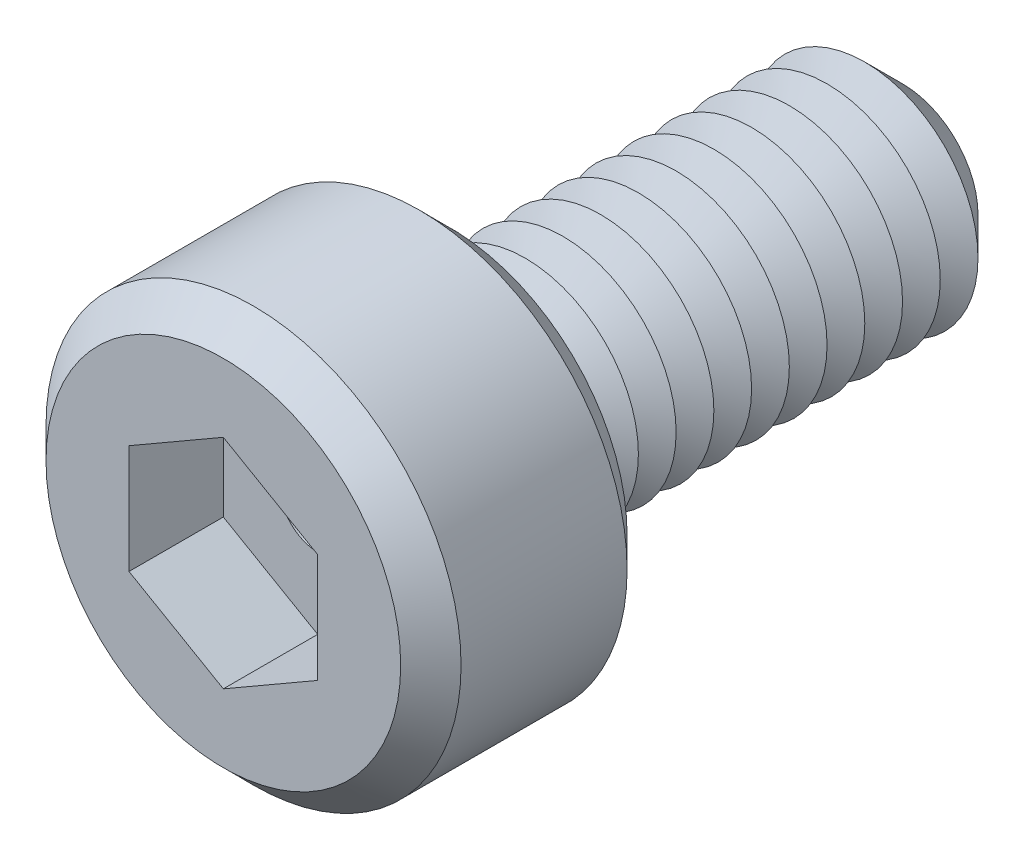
ISO-10303-21;
HEADER;
FILE_DESCRIPTION(('STEP AP214'),'2;1');
FILE_NAME('part.step','',(''),(''),'','','');
FILE_SCHEMA(('AUTOMOTIVE_DESIGN { 1 0 10303 214 1 1 1 1 }'));
ENDSEC;
DATA;
#1=APPLICATION_CONTEXT('core data for automotive mechanical design processes');
#2=APPLICATION_PROTOCOL_DEFINITION('international standard','automotive_design',2000,#1);
#3=PRODUCT_CONTEXT('',#1,'mechanical');
#4=PRODUCT('Part','Part','',(#3));
#5=PRODUCT_RELATED_PRODUCT_CATEGORY('part','',(#4));
#6=PRODUCT_DEFINITION_FORMATION('','',#4);
#7=PRODUCT_DEFINITION_CONTEXT('part definition',#1,'design');
#8=PRODUCT_DEFINITION('design','',#6,#7);
#9=PRODUCT_DEFINITION_SHAPE('','',#8);
#10=(LENGTH_UNIT() NAMED_UNIT(*) SI_UNIT(.MILLI.,.METRE.));
#11=(NAMED_UNIT(*) PLANE_ANGLE_UNIT() SI_UNIT($,.RADIAN.));
#12=(NAMED_UNIT(*) SI_UNIT($,.STERADIAN.) SOLID_ANGLE_UNIT());
#13=UNCERTAINTY_MEASURE_WITH_UNIT(LENGTH_MEASURE(1.E-05),#10,'distance_accuracy_value','');
#14=(GEOMETRIC_REPRESENTATION_CONTEXT(3) GLOBAL_UNCERTAINTY_ASSIGNED_CONTEXT((#13)) GLOBAL_UNIT_ASSIGNED_CONTEXT((#10,
#11,#12)) REPRESENTATION_CONTEXT('',''));
#15=CARTESIAN_POINT('',(0.,0.,0.));
#16=DIRECTION('',(0.,0.,1.));
#17=DIRECTION('',(1.,0.,0.));
#18=AXIS2_PLACEMENT_3D('',#15,#16,#17);
#19=CARTESIAN_POINT('',(0.,0.,3.));
#20=DIRECTION('',(0.,0.,-1.));
#21=DIRECTION('',(-1.,0.,0.));
#22=AXIS2_PLACEMENT_3D('',#19,#20,#21);
#23=CYLINDRICAL_SURFACE('',#22,2.75);
#24=CARTESIAN_POINT('',(0.,0.,0.4));
#25=DIRECTION('',(0.,0.,1.));
#26=DIRECTION('',(1.,0.,0.));
#27=AXIS2_PLACEMENT_3D('',#24,#25,#26);
#28=CIRCLE('',#27,2.75);
#29=CARTESIAN_POINT('',(2.75,0.,0.4));
#30=VERTEX_POINT('',#29);
#31=EDGE_CURVE('E264',#30,#30,#28,.T.);
#32=ORIENTED_EDGE('',*,*,#31,.T.);
#33=EDGE_LOOP('',(#32));
#34=FACE_BOUND('',#33,.T.);
#35=CARTESIAN_POINT('',(0.,0.,2.6));
#36=DIRECTION('',(0.,0.,1.));
#37=DIRECTION('',(1.,0.,0.));
#38=AXIS2_PLACEMENT_3D('',#35,#36,#37);
#39=CIRCLE('',#38,2.75);
#40=CARTESIAN_POINT('',(2.75,0.,2.6));
#41=VERTEX_POINT('',#40);
#42=EDGE_CURVE('E260',#41,#41,#39,.F.);
#43=ORIENTED_EDGE('',*,*,#42,.T.);
#44=EDGE_LOOP('',(#43));
#45=FACE_BOUND('',#44,.T.);
#46=ADVANCED_FACE('F39',(#34,#45),#23,.T.);
#47=CARTESIAN_POINT('',(0.,0.,3.));
#48=DIRECTION('',(0.,0.,1.));
#49=DIRECTION('',(1.,0.,0.));
#50=AXIS2_PLACEMENT_3D('',#47,#48,#49);
#51=PLANE('',#50);
#52=CARTESIAN_POINT('',(0.,0.,3.));
#53=DIRECTION('',(0.,0.,1.));
#54=DIRECTION('',(1.,0.,0.));
#55=AXIS2_PLACEMENT_3D('',#52,#53,#54);
#56=CIRCLE('',#55,2.35);
#57=CARTESIAN_POINT('',(2.35,0.,3.));
#58=VERTEX_POINT('',#57);
#59=EDGE_CURVE('E11',#58,#58,#56,.T.);
#60=ORIENTED_EDGE('',*,*,#59,.T.);
#61=EDGE_LOOP('',(#60));
#62=FACE_BOUND('',#61,.T.);
#63=DIRECTION('',(-0.866025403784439,0.5,0.));
#64=VECTOR('',#63,1.);
#65=CARTESIAN_POINT('',(1.25,0.721687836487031,3.));
#66=LINE('',#65,#64);
#67=CARTESIAN_POINT('',(1.25,0.721687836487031,3.));
#68=VERTEX_POINT('',#67);
#69=CARTESIAN_POINT('',(0.,1.44337567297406,3.));
#70=VERTEX_POINT('',#69);
#71=EDGE_CURVE('E55',#68,#70,#66,.T.);
#72=ORIENTED_EDGE('',*,*,#71,.F.);
#73=DIRECTION('',(0.,1.,0.));
#74=VECTOR('',#73,1.);
#75=CARTESIAN_POINT('',(1.25,-0.721687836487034,3.));
#76=LINE('',#75,#74);
#77=CARTESIAN_POINT('',(1.25,-0.721687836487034,3.));
#78=VERTEX_POINT('',#77);
#79=EDGE_CURVE('E150',#78,#68,#76,.T.);
#80=ORIENTED_EDGE('',*,*,#79,.F.);
#81=DIRECTION('',(0.866025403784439,0.5,0.));
#82=VECTOR('',#81,1.);
#83=CARTESIAN_POINT('',(0.,-1.44337567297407,3.));
#84=LINE('',#83,#82);
#85=CARTESIAN_POINT('',(0.,-1.44337567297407,3.));
#86=VERTEX_POINT('',#85);
#87=EDGE_CURVE('E147',#86,#78,#84,.T.);
#88=ORIENTED_EDGE('',*,*,#87,.F.);
#89=DIRECTION('',(0.866025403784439,-0.5,0.));
#90=VECTOR('',#89,1.);
#91=CARTESIAN_POINT('',(-1.25,-0.721687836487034,3.));
#92=LINE('',#91,#90);
#93=CARTESIAN_POINT('',(-1.25,-0.721687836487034,3.));
#94=VERTEX_POINT('',#93);
#95=EDGE_CURVE('E103',#94,#86,#92,.T.);
#96=ORIENTED_EDGE('',*,*,#95,.F.);
#97=DIRECTION('',(0.,-1.,0.));
#98=VECTOR('',#97,1.);
#99=CARTESIAN_POINT('',(-1.25,0.721687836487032,3.));
#100=LINE('',#99,#98);
#101=CARTESIAN_POINT('',(-1.25,0.721687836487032,3.));
#102=VERTEX_POINT('',#101);
#103=EDGE_CURVE('E141',#102,#94,#100,.T.);
#104=ORIENTED_EDGE('',*,*,#103,.F.);
#105=DIRECTION('',(-0.866025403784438,-0.5,0.));
#106=VECTOR('',#105,1.);
#107=CARTESIAN_POINT('',(0.,1.44337567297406,3.));
#108=LINE('',#107,#106);
#109=EDGE_CURVE('E136',#70,#102,#108,.T.);
#110=ORIENTED_EDGE('',*,*,#109,.F.);
#111=EDGE_LOOP('',(#72,#80,#88,#96,#104,#110));
#112=FACE_BOUND('',#111,.T.);
#113=ADVANCED_FACE('F282',(#62,#112),#51,.T.);
#114=CARTESIAN_POINT('',(0.,0.,0.));
#115=DIRECTION('',(0.,0.,1.));
#116=DIRECTION('',(1.,0.,0.));
#117=AXIS2_PLACEMENT_3D('',#114,#115,#116);
#118=PLANE('',#117);
#119=CARTESIAN_POINT('',(0.,0.,0.));
#120=DIRECTION('',(0.,0.,1.));
#121=DIRECTION('',(1.,0.,0.));
#122=AXIS2_PLACEMENT_3D('',#119,#120,#121);
#123=CIRCLE('',#122,2.35);
#124=CARTESIAN_POINT('',(2.35,0.,0.));
#125=VERTEX_POINT('',#124);
#126=EDGE_CURVE('E48',#125,#125,#123,.F.);
#127=ORIENTED_EDGE('',*,*,#126,.T.);
#128=EDGE_LOOP('',(#127));
#129=FACE_BOUND('',#128,.T.);
#130=CARTESIAN_POINT('',(0.,0.,0.));
#131=DIRECTION('',(0.,0.,1.));
#132=DIRECTION('',(1.,0.,0.));
#133=AXIS2_PLACEMENT_3D('',#130,#131,#132);
#134=CIRCLE('',#133,1.5);
#135=CARTESIAN_POINT('',(1.5,0.,0.));
#136=VERTEX_POINT('',#135);
#137=EDGE_CURVE('E252',#136,#136,#134,.T.);
#138=ORIENTED_EDGE('',*,*,#137,.T.);
#139=EDGE_LOOP('',(#138));
#140=FACE_BOUND('',#139,.T.);
#141=ADVANCED_FACE('F271',(#129,#140),#118,.F.);
#142=CARTESIAN_POINT('',(0.,0.,0.));
#143=DIRECTION('',(0.,0.,1.));
#144=DIRECTION('',(1.,0.,0.));
#145=AXIS2_PLACEMENT_3D('',#142,#143,#144);
#146=CONICAL_SURFACE('',#145,1.5,1.0471975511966);
#147=CARTESIAN_POINT('',(0.,0.,-0.250000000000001));
#148=DIRECTION('',(0.,0.,1.));
#149=DIRECTION('',(1.,0.,0.));
#150=AXIS2_PLACEMENT_3D('',#147,#148,#149);
#151=CIRCLE('',#150,1.06698729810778);
#152=CARTESIAN_POINT('',(1.06698729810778,0.,-0.250000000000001));
#153=VERTEX_POINT('',#152);
#154=EDGE_CURVE('E248',#153,#153,#151,.T.);
#155=ORIENTED_EDGE('',*,*,#154,.T.);
#156=EDGE_LOOP('',(#155));
#157=FACE_BOUND('',#156,.T.);
#158=ORIENTED_EDGE('',*,*,#137,.F.);
#159=EDGE_LOOP('',(#158));
#160=FACE_BOUND('',#159,.T.);
#161=ADVANCED_FACE('F420',(#157,#160),#146,.T.);
#162=CARTESIAN_POINT('',(0.,0.,-0.250000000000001));
#163=DIRECTION('',(0.,0.,-1.));
#164=DIRECTION('',(-1.,0.,0.));
#165=AXIS2_PLACEMENT_3D('',#162,#163,#164);
#166=CONICAL_SURFACE('',#165,1.06698729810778,1.0471975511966);
#167=CARTESIAN_POINT('',(0.,0.,-0.5));
#168=DIRECTION('',(0.,0.,1.));
#169=DIRECTION('',(1.,0.,0.));
#170=AXIS2_PLACEMENT_3D('',#167,#168,#169);
#171=CIRCLE('',#170,1.5);
#172=CARTESIAN_POINT('',(1.5,0.,-0.5));
#173=VERTEX_POINT('',#172);
#174=EDGE_CURVE('E244',#173,#173,#171,.T.);
#175=ORIENTED_EDGE('',*,*,#174,.T.);
#176=EDGE_LOOP('',(#175));
#177=FACE_BOUND('',#176,.T.);
#178=ORIENTED_EDGE('',*,*,#154,.F.);
#179=EDGE_LOOP('',(#178));
#180=FACE_BOUND('',#179,.T.);
#181=ADVANCED_FACE('F416',(#177,#180),#166,.T.);
#182=CARTESIAN_POINT('',(0.,0.,-0.5));
#183=DIRECTION('',(0.,0.,1.));
#184=DIRECTION('',(1.,0.,0.));
#185=AXIS2_PLACEMENT_3D('',#182,#183,#184);
#186=CONICAL_SURFACE('',#185,1.5,1.0471975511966);
#187=CARTESIAN_POINT('',(0.,0.,-0.750000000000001));
#188=DIRECTION('',(0.,0.,1.));
#189=DIRECTION('',(1.,0.,0.));
#190=AXIS2_PLACEMENT_3D('',#187,#188,#189);
#191=CIRCLE('',#190,1.06698729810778);
#192=CARTESIAN_POINT('',(1.06698729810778,0.,-0.750000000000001));
#193=VERTEX_POINT('',#192);
#194=EDGE_CURVE('E240',#193,#193,#191,.T.);
#195=ORIENTED_EDGE('',*,*,#194,.T.);
#196=EDGE_LOOP('',(#195));
#197=FACE_BOUND('',#196,.T.);
#198=ORIENTED_EDGE('',*,*,#174,.F.);
#199=EDGE_LOOP('',(#198));
#200=FACE_BOUND('',#199,.T.);
#201=ADVANCED_FACE('F412',(#197,#200),#186,.T.);
#202=CARTESIAN_POINT('',(0.,0.,-0.750000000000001));
#203=DIRECTION('',(0.,0.,-1.));
#204=DIRECTION('',(-1.,0.,0.));
#205=AXIS2_PLACEMENT_3D('',#202,#203,#204);
#206=CONICAL_SURFACE('',#205,1.06698729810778,1.0471975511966);
#207=CARTESIAN_POINT('',(0.,0.,-1.));
#208=DIRECTION('',(0.,0.,1.));
#209=DIRECTION('',(1.,0.,0.));
#210=AXIS2_PLACEMENT_3D('',#207,#208,#209);
#211=CIRCLE('',#210,1.5);
#212=CARTESIAN_POINT('',(1.5,0.,-1.));
#213=VERTEX_POINT('',#212);
#214=EDGE_CURVE('E236',#213,#213,#211,.T.);
#215=ORIENTED_EDGE('',*,*,#214,.T.);
#216=EDGE_LOOP('',(#215));
#217=FACE_BOUND('',#216,.T.);
#218=ORIENTED_EDGE('',*,*,#194,.F.);
#219=EDGE_LOOP('',(#218));
#220=FACE_BOUND('',#219,.T.);
#221=ADVANCED_FACE('F408',(#217,#220),#206,.T.);
#222=CARTESIAN_POINT('',(0.,0.,-1.));
#223=DIRECTION('',(0.,0.,1.));
#224=DIRECTION('',(1.,0.,0.));
#225=AXIS2_PLACEMENT_3D('',#222,#223,#224);
#226=CONICAL_SURFACE('',#225,1.5,1.0471975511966);
#227=CARTESIAN_POINT('',(0.,0.,-1.25));
#228=DIRECTION('',(0.,0.,1.));
#229=DIRECTION('',(1.,0.,0.));
#230=AXIS2_PLACEMENT_3D('',#227,#228,#229);
#231=CIRCLE('',#230,1.06698729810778);
#232=CARTESIAN_POINT('',(1.06698729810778,0.,-1.25));
#233=VERTEX_POINT('',#232);
#234=EDGE_CURVE('E232',#233,#233,#231,.T.);
#235=ORIENTED_EDGE('',*,*,#234,.T.);
#236=EDGE_LOOP('',(#235));
#237=FACE_BOUND('',#236,.T.);
#238=ORIENTED_EDGE('',*,*,#214,.F.);
#239=EDGE_LOOP('',(#238));
#240=FACE_BOUND('',#239,.T.);
#241=ADVANCED_FACE('F404',(#237,#240),#226,.T.);
#242=CARTESIAN_POINT('',(0.,0.,-1.25));
#243=DIRECTION('',(0.,0.,-1.));
#244=DIRECTION('',(-1.,0.,0.));
#245=AXIS2_PLACEMENT_3D('',#242,#243,#244);
#246=CONICAL_SURFACE('',#245,1.06698729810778,1.0471975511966);
#247=CARTESIAN_POINT('',(0.,0.,-1.5));
#248=DIRECTION('',(0.,0.,1.));
#249=DIRECTION('',(1.,0.,0.));
#250=AXIS2_PLACEMENT_3D('',#247,#248,#249);
#251=CIRCLE('',#250,1.5);
#252=CARTESIAN_POINT('',(1.5,0.,-1.5));
#253=VERTEX_POINT('',#252);
#254=EDGE_CURVE('E228',#253,#253,#251,.T.);
#255=ORIENTED_EDGE('',*,*,#254,.T.);
#256=EDGE_LOOP('',(#255));
#257=FACE_BOUND('',#256,.T.);
#258=ORIENTED_EDGE('',*,*,#234,.F.);
#259=EDGE_LOOP('',(#258));
#260=FACE_BOUND('',#259,.T.);
#261=ADVANCED_FACE('F400',(#257,#260),#246,.T.);
#262=CARTESIAN_POINT('',(0.,0.,-1.5));
#263=DIRECTION('',(0.,0.,1.));
#264=DIRECTION('',(1.,0.,0.));
#265=AXIS2_PLACEMENT_3D('',#262,#263,#264);
#266=CONICAL_SURFACE('',#265,1.5,1.0471975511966);
#267=CARTESIAN_POINT('',(0.,0.,-1.75));
#268=DIRECTION('',(0.,0.,1.));
#269=DIRECTION('',(1.,0.,0.));
#270=AXIS2_PLACEMENT_3D('',#267,#268,#269);
#271=CIRCLE('',#270,1.06698729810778);
#272=CARTESIAN_POINT('',(1.06698729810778,0.,-1.75));
#273=VERTEX_POINT('',#272);
#274=EDGE_CURVE('E224',#273,#273,#271,.T.);
#275=ORIENTED_EDGE('',*,*,#274,.T.);
#276=EDGE_LOOP('',(#275));
#277=FACE_BOUND('',#276,.T.);
#278=ORIENTED_EDGE('',*,*,#254,.F.);
#279=EDGE_LOOP('',(#278));
#280=FACE_BOUND('',#279,.T.);
#281=ADVANCED_FACE('F396',(#277,#280),#266,.T.);
#282=CARTESIAN_POINT('',(0.,0.,-1.75));
#283=DIRECTION('',(0.,0.,-1.));
#284=DIRECTION('',(-1.,0.,0.));
#285=AXIS2_PLACEMENT_3D('',#282,#283,#284);
#286=CONICAL_SURFACE('',#285,1.06698729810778,1.0471975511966);
#287=CARTESIAN_POINT('',(0.,0.,-2.));
#288=DIRECTION('',(0.,0.,1.));
#289=DIRECTION('',(1.,0.,0.));
#290=AXIS2_PLACEMENT_3D('',#287,#288,#289);
#291=CIRCLE('',#290,1.5);
#292=CARTESIAN_POINT('',(1.5,0.,-2.));
#293=VERTEX_POINT('',#292);
#294=EDGE_CURVE('E220',#293,#293,#291,.T.);
#295=ORIENTED_EDGE('',*,*,#294,.T.);
#296=EDGE_LOOP('',(#295));
#297=FACE_BOUND('',#296,.T.);
#298=ORIENTED_EDGE('',*,*,#274,.F.);
#299=EDGE_LOOP('',(#298));
#300=FACE_BOUND('',#299,.T.);
#301=ADVANCED_FACE('F392',(#297,#300),#286,.T.);
#302=CARTESIAN_POINT('',(0.,0.,-2.));
#303=DIRECTION('',(0.,0.,1.));
#304=DIRECTION('',(1.,0.,0.));
#305=AXIS2_PLACEMENT_3D('',#302,#303,#304);
#306=CONICAL_SURFACE('',#305,1.5,1.0471975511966);
#307=CARTESIAN_POINT('',(0.,0.,-2.25));
#308=DIRECTION('',(0.,0.,1.));
#309=DIRECTION('',(1.,0.,0.));
#310=AXIS2_PLACEMENT_3D('',#307,#308,#309);
#311=CIRCLE('',#310,1.06698729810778);
#312=CARTESIAN_POINT('',(1.06698729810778,0.,-2.25));
#313=VERTEX_POINT('',#312);
#314=EDGE_CURVE('E216',#313,#313,#311,.T.);
#315=ORIENTED_EDGE('',*,*,#314,.T.);
#316=EDGE_LOOP('',(#315));
#317=FACE_BOUND('',#316,.T.);
#318=ORIENTED_EDGE('',*,*,#294,.F.);
#319=EDGE_LOOP('',(#318));
#320=FACE_BOUND('',#319,.T.);
#321=ADVANCED_FACE('F388',(#317,#320),#306,.T.);
#322=CARTESIAN_POINT('',(0.,0.,-2.25));
#323=DIRECTION('',(0.,0.,-1.));
#324=DIRECTION('',(-1.,0.,0.));
#325=AXIS2_PLACEMENT_3D('',#322,#323,#324);
#326=CONICAL_SURFACE('',#325,1.06698729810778,1.0471975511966);
#327=CARTESIAN_POINT('',(0.,0.,-2.5));
#328=DIRECTION('',(0.,0.,1.));
#329=DIRECTION('',(1.,0.,0.));
#330=AXIS2_PLACEMENT_3D('',#327,#328,#329);
#331=CIRCLE('',#330,1.5);
#332=CARTESIAN_POINT('',(1.5,0.,-2.5));
#333=VERTEX_POINT('',#332);
#334=EDGE_CURVE('E212',#333,#333,#331,.T.);
#335=ORIENTED_EDGE('',*,*,#334,.T.);
#336=EDGE_LOOP('',(#335));
#337=FACE_BOUND('',#336,.T.);
#338=ORIENTED_EDGE('',*,*,#314,.F.);
#339=EDGE_LOOP('',(#338));
#340=FACE_BOUND('',#339,.T.);
#341=ADVANCED_FACE('F384',(#337,#340),#326,.T.);
#342=CARTESIAN_POINT('',(0.,0.,-2.5));
#343=DIRECTION('',(0.,0.,1.));
#344=DIRECTION('',(1.,0.,0.));
#345=AXIS2_PLACEMENT_3D('',#342,#343,#344);
#346=CONICAL_SURFACE('',#345,1.5,1.0471975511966);
#347=CARTESIAN_POINT('',(0.,0.,-2.75));
#348=DIRECTION('',(0.,0.,1.));
#349=DIRECTION('',(1.,0.,0.));
#350=AXIS2_PLACEMENT_3D('',#347,#348,#349);
#351=CIRCLE('',#350,1.06698729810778);
#352=CARTESIAN_POINT('',(1.06698729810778,0.,-2.75));
#353=VERTEX_POINT('',#352);
#354=EDGE_CURVE('E208',#353,#353,#351,.T.);
#355=ORIENTED_EDGE('',*,*,#354,.T.);
#356=EDGE_LOOP('',(#355));
#357=FACE_BOUND('',#356,.T.);
#358=ORIENTED_EDGE('',*,*,#334,.F.);
#359=EDGE_LOOP('',(#358));
#360=FACE_BOUND('',#359,.T.);
#361=ADVANCED_FACE('F380',(#357,#360),#346,.T.);
#362=CARTESIAN_POINT('',(0.,0.,-2.75));
#363=DIRECTION('',(0.,0.,-1.));
#364=DIRECTION('',(-1.,0.,0.));
#365=AXIS2_PLACEMENT_3D('',#362,#363,#364);
#366=CONICAL_SURFACE('',#365,1.06698729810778,1.0471975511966);
#367=CARTESIAN_POINT('',(0.,0.,-3.));
#368=DIRECTION('',(0.,0.,1.));
#369=DIRECTION('',(1.,0.,0.));
#370=AXIS2_PLACEMENT_3D('',#367,#368,#369);
#371=CIRCLE('',#370,1.5);
#372=CARTESIAN_POINT('',(1.5,0.,-3.));
#373=VERTEX_POINT('',#372);
#374=EDGE_CURVE('E204',#373,#373,#371,.T.);
#375=ORIENTED_EDGE('',*,*,#374,.T.);
#376=EDGE_LOOP('',(#375));
#377=FACE_BOUND('',#376,.T.);
#378=ORIENTED_EDGE('',*,*,#354,.F.);
#379=EDGE_LOOP('',(#378));
#380=FACE_BOUND('',#379,.T.);
#381=ADVANCED_FACE('F376',(#377,#380),#366,.T.);
#382=CARTESIAN_POINT('',(0.,0.,-3.));
#383=DIRECTION('',(0.,0.,1.));
#384=DIRECTION('',(1.,0.,0.));
#385=AXIS2_PLACEMENT_3D('',#382,#383,#384);
#386=CONICAL_SURFACE('',#385,1.5,1.0471975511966);
#387=CARTESIAN_POINT('',(0.,0.,-3.25));
#388=DIRECTION('',(0.,0.,1.));
#389=DIRECTION('',(1.,0.,0.));
#390=AXIS2_PLACEMENT_3D('',#387,#388,#389);
#391=CIRCLE('',#390,1.06698729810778);
#392=CARTESIAN_POINT('',(1.06698729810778,0.,-3.25));
#393=VERTEX_POINT('',#392);
#394=EDGE_CURVE('E200',#393,#393,#391,.T.);
#395=ORIENTED_EDGE('',*,*,#394,.T.);
#396=EDGE_LOOP('',(#395));
#397=FACE_BOUND('',#396,.T.);
#398=ORIENTED_EDGE('',*,*,#374,.F.);
#399=EDGE_LOOP('',(#398));
#400=FACE_BOUND('',#399,.T.);
#401=ADVANCED_FACE('F372',(#397,#400),#386,.T.);
#402=CARTESIAN_POINT('',(0.,0.,-3.25));
#403=DIRECTION('',(0.,0.,-1.));
#404=DIRECTION('',(-1.,0.,0.));
#405=AXIS2_PLACEMENT_3D('',#402,#403,#404);
#406=CONICAL_SURFACE('',#405,1.06698729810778,1.0471975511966);
#407=CARTESIAN_POINT('',(0.,0.,-3.5));
#408=DIRECTION('',(0.,0.,1.));
#409=DIRECTION('',(1.,0.,0.));
#410=AXIS2_PLACEMENT_3D('',#407,#408,#409);
#411=CIRCLE('',#410,1.5);
#412=CARTESIAN_POINT('',(1.5,0.,-3.5));
#413=VERTEX_POINT('',#412);
#414=EDGE_CURVE('E196',#413,#413,#411,.T.);
#415=ORIENTED_EDGE('',*,*,#414,.T.);
#416=EDGE_LOOP('',(#415));
#417=FACE_BOUND('',#416,.T.);
#418=ORIENTED_EDGE('',*,*,#394,.F.);
#419=EDGE_LOOP('',(#418));
#420=FACE_BOUND('',#419,.T.);
#421=ADVANCED_FACE('F368',(#417,#420),#406,.T.);
#422=CARTESIAN_POINT('',(0.,0.,-3.5));
#423=DIRECTION('',(0.,0.,1.));
#424=DIRECTION('',(1.,0.,0.));
#425=AXIS2_PLACEMENT_3D('',#422,#423,#424);
#426=CONICAL_SURFACE('',#425,1.5,1.0471975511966);
#427=CARTESIAN_POINT('',(0.,0.,-3.75));
#428=DIRECTION('',(0.,0.,1.));
#429=DIRECTION('',(1.,0.,0.));
#430=AXIS2_PLACEMENT_3D('',#427,#428,#429);
#431=CIRCLE('',#430,1.06698729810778);
#432=CARTESIAN_POINT('',(1.06698729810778,0.,-3.75));
#433=VERTEX_POINT('',#432);
#434=EDGE_CURVE('E192',#433,#433,#431,.T.);
#435=ORIENTED_EDGE('',*,*,#434,.T.);
#436=EDGE_LOOP('',(#435));
#437=FACE_BOUND('',#436,.T.);
#438=ORIENTED_EDGE('',*,*,#414,.F.);
#439=EDGE_LOOP('',(#438));
#440=FACE_BOUND('',#439,.T.);
#441=ADVANCED_FACE('F364',(#437,#440),#426,.T.);
#442=CARTESIAN_POINT('',(0.,0.,-3.75));
#443=DIRECTION('',(0.,0.,-1.));
#444=DIRECTION('',(-1.,0.,0.));
#445=AXIS2_PLACEMENT_3D('',#442,#443,#444);
#446=CONICAL_SURFACE('',#445,1.06698729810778,1.0471975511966);
#447=CARTESIAN_POINT('',(0.,0.,-4.));
#448=DIRECTION('',(0.,0.,1.));
#449=DIRECTION('',(1.,0.,0.));
#450=AXIS2_PLACEMENT_3D('',#447,#448,#449);
#451=CIRCLE('',#450,1.5);
#452=CARTESIAN_POINT('',(1.5,0.,-4.));
#453=VERTEX_POINT('',#452);
#454=EDGE_CURVE('E188',#453,#453,#451,.T.);
#455=ORIENTED_EDGE('',*,*,#454,.T.);
#456=EDGE_LOOP('',(#455));
#457=FACE_BOUND('',#456,.T.);
#458=ORIENTED_EDGE('',*,*,#434,.F.);
#459=EDGE_LOOP('',(#458));
#460=FACE_BOUND('',#459,.T.);
#461=ADVANCED_FACE('F360',(#457,#460),#446,.T.);
#462=CARTESIAN_POINT('',(0.,0.,-4.));
#463=DIRECTION('',(0.,0.,1.));
#464=DIRECTION('',(1.,0.,0.));
#465=AXIS2_PLACEMENT_3D('',#462,#463,#464);
#466=CONICAL_SURFACE('',#465,1.5,1.0471975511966);
#467=CARTESIAN_POINT('',(0.,0.,-4.25));
#468=DIRECTION('',(0.,0.,1.));
#469=DIRECTION('',(1.,0.,0.));
#470=AXIS2_PLACEMENT_3D('',#467,#468,#469);
#471=CIRCLE('',#470,1.06698729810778);
#472=CARTESIAN_POINT('',(1.06698729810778,0.,-4.25));
#473=VERTEX_POINT('',#472);
#474=EDGE_CURVE('E184',#473,#473,#471,.T.);
#475=ORIENTED_EDGE('',*,*,#474,.T.);
#476=EDGE_LOOP('',(#475));
#477=FACE_BOUND('',#476,.T.);
#478=ORIENTED_EDGE('',*,*,#454,.F.);
#479=EDGE_LOOP('',(#478));
#480=FACE_BOUND('',#479,.T.);
#481=ADVANCED_FACE('F356',(#477,#480),#466,.T.);
#482=CARTESIAN_POINT('',(0.,0.,-4.25));
#483=DIRECTION('',(0.,0.,-1.));
#484=DIRECTION('',(-1.,0.,0.));
#485=AXIS2_PLACEMENT_3D('',#482,#483,#484);
#486=CONICAL_SURFACE('',#485,1.06698729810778,1.0471975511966);
#487=CARTESIAN_POINT('',(0.,0.,-4.5));
#488=DIRECTION('',(0.,0.,1.));
#489=DIRECTION('',(1.,0.,0.));
#490=AXIS2_PLACEMENT_3D('',#487,#488,#489);
#491=CIRCLE('',#490,1.5);
#492=CARTESIAN_POINT('',(1.5,0.,-4.5));
#493=VERTEX_POINT('',#492);
#494=EDGE_CURVE('E180',#493,#493,#491,.T.);
#495=ORIENTED_EDGE('',*,*,#494,.T.);
#496=EDGE_LOOP('',(#495));
#497=FACE_BOUND('',#496,.T.);
#498=ORIENTED_EDGE('',*,*,#474,.F.);
#499=EDGE_LOOP('',(#498));
#500=FACE_BOUND('',#499,.T.);
#501=ADVANCED_FACE('F352',(#497,#500),#486,.T.);
#502=CARTESIAN_POINT('',(0.,0.,-4.5));
#503=DIRECTION('',(0.,0.,1.));
#504=DIRECTION('',(1.,0.,0.));
#505=AXIS2_PLACEMENT_3D('',#502,#503,#504);
#506=CONICAL_SURFACE('',#505,1.5,1.0471975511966);
#507=CARTESIAN_POINT('',(0.,0.,-4.75));
#508=DIRECTION('',(0.,0.,1.));
#509=DIRECTION('',(1.,0.,0.));
#510=AXIS2_PLACEMENT_3D('',#507,#508,#509);
#511=CIRCLE('',#510,1.06698729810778);
#512=CARTESIAN_POINT('',(1.06698729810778,0.,-4.75));
#513=VERTEX_POINT('',#512);
#514=EDGE_CURVE('E176',#513,#513,#511,.T.);
#515=ORIENTED_EDGE('',*,*,#514,.T.);
#516=EDGE_LOOP('',(#515));
#517=FACE_BOUND('',#516,.T.);
#518=ORIENTED_EDGE('',*,*,#494,.F.);
#519=EDGE_LOOP('',(#518));
#520=FACE_BOUND('',#519,.T.);
#521=ADVANCED_FACE('F348',(#517,#520),#506,.T.);
#522=CARTESIAN_POINT('',(0.,0.,-4.75));
#523=DIRECTION('',(0.,0.,-1.));
#524=DIRECTION('',(-1.,0.,0.));
#525=AXIS2_PLACEMENT_3D('',#522,#523,#524);
#526=CONICAL_SURFACE('',#525,1.06698729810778,1.0471975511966);
#527=CARTESIAN_POINT('',(0.,0.,-5.));
#528=DIRECTION('',(0.,0.,1.));
#529=DIRECTION('',(1.,0.,0.));
#530=AXIS2_PLACEMENT_3D('',#527,#528,#529);
#531=CIRCLE('',#530,1.5);
#532=CARTESIAN_POINT('',(1.5,0.,-5.));
#533=VERTEX_POINT('',#532);
#534=EDGE_CURVE('E172',#533,#533,#531,.T.);
#535=ORIENTED_EDGE('',*,*,#534,.T.);
#536=EDGE_LOOP('',(#535));
#537=FACE_BOUND('',#536,.T.);
#538=ORIENTED_EDGE('',*,*,#514,.F.);
#539=EDGE_LOOP('',(#538));
#540=FACE_BOUND('',#539,.T.);
#541=ADVANCED_FACE('F344',(#537,#540),#526,.T.);
#542=CARTESIAN_POINT('',(0.,0.,-5.));
#543=DIRECTION('',(0.,0.,1.));
#544=DIRECTION('',(1.,0.,0.));
#545=AXIS2_PLACEMENT_3D('',#542,#543,#544);
#546=CONICAL_SURFACE('',#545,1.5,1.0471975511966);
#547=CARTESIAN_POINT('',(0.,0.,-5.25));
#548=DIRECTION('',(0.,0.,1.));
#549=DIRECTION('',(1.,0.,0.));
#550=AXIS2_PLACEMENT_3D('',#547,#548,#549);
#551=CIRCLE('',#550,1.06698729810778);
#552=CARTESIAN_POINT('',(1.06698729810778,0.,-5.25));
#553=VERTEX_POINT('',#552);
#554=EDGE_CURVE('E169',#553,#553,#551,.T.);
#555=ORIENTED_EDGE('',*,*,#554,.T.);
#556=EDGE_LOOP('',(#555));
#557=FACE_BOUND('',#556,.T.);
#558=ORIENTED_EDGE('',*,*,#534,.F.);
#559=EDGE_LOOP('',(#558));
#560=FACE_BOUND('',#559,.T.);
#561=ADVANCED_FACE('F340',(#557,#560),#546,.T.);
#562=CARTESIAN_POINT('',(0.,0.,-5.25));
#563=DIRECTION('',(0.,0.,-1.));
#564=DIRECTION('',(-1.,0.,0.));
#565=AXIS2_PLACEMENT_3D('',#562,#563,#564);
#566=CONICAL_SURFACE('',#565,1.06698729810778,1.0471975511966);
#567=CARTESIAN_POINT('',(0.,0.,-5.5));
#568=DIRECTION('',(0.,0.,1.));
#569=DIRECTION('',(1.,0.,0.));
#570=AXIS2_PLACEMENT_3D('',#567,#568,#569);
#571=CIRCLE('',#570,1.5);
#572=CARTESIAN_POINT('',(1.5,0.,-5.5));
#573=VERTEX_POINT('',#572);
#574=EDGE_CURVE('E156',#573,#573,#571,.T.);
#575=ORIENTED_EDGE('',*,*,#574,.T.);
#576=EDGE_LOOP('',(#575));
#577=FACE_BOUND('',#576,.T.);
#578=ORIENTED_EDGE('',*,*,#554,.F.);
#579=EDGE_LOOP('',(#578));
#580=FACE_BOUND('',#579,.T.);
#581=ADVANCED_FACE('F336',(#577,#580),#566,.T.);
#582=CARTESIAN_POINT('',(0.,0.,-6.));
#583=DIRECTION('',(0.,0.,-1.));
#584=DIRECTION('',(-1.,0.,0.));
#585=AXIS2_PLACEMENT_3D('',#582,#583,#584);
#586=PLANE('',#585);
#587=CARTESIAN_POINT('',(0.,0.,-6.));
#588=DIRECTION('',(0.,0.,-1.));
#589=DIRECTION('',(-1.,0.,0.));
#590=AXIS2_PLACEMENT_3D('',#587,#588,#589);
#591=CIRCLE('',#590,0.5);
#592=CARTESIAN_POINT('',(-0.5,0.,-6.));
#593=VERTEX_POINT('',#592);
#594=EDGE_CURVE('E137',#593,#593,#591,.F.);
#595=ORIENTED_EDGE('',*,*,#594,.T.);
#596=EDGE_LOOP('',(#595));
#597=FACE_BOUND('',#596,.T.);
#598=CARTESIAN_POINT('',(0.,0.,-6.));
#599=DIRECTION('',(0.,0.,-1.));
#600=DIRECTION('',(-1.,0.,0.));
#601=AXIS2_PLACEMENT_3D('',#598,#599,#600);
#602=CIRCLE('',#601,1.);
#603=CARTESIAN_POINT('',(-1.,0.,-6.));
#604=VERTEX_POINT('',#603);
#605=EDGE_CURVE('E256',#604,#604,#602,.T.);
#606=ORIENTED_EDGE('',*,*,#605,.T.);
#607=EDGE_LOOP('',(#606));
#608=FACE_BOUND('',#607,.T.);
#609=ADVANCED_FACE('F339',(#597,#608),#586,.T.);
#610=CARTESIAN_POINT('',(0.,0.,-6.));
#611=DIRECTION('',(0.,0.,1.));
#612=DIRECTION('',(1.,0.,0.));
#613=AXIS2_PLACEMENT_3D('',#610,#611,#612);
#614=CONICAL_SURFACE('',#613,1.,0.785398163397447);
#615=ORIENTED_EDGE('',*,*,#574,.F.);
#616=EDGE_LOOP('',(#615));
#617=FACE_BOUND('',#616,.T.);
#618=ORIENTED_EDGE('',*,*,#605,.F.);
#619=EDGE_LOOP('',(#618));
#620=FACE_BOUND('',#619,.T.);
#621=ADVANCED_FACE('F335',(#617,#620),#614,.T.);
#622=CARTESIAN_POINT('',(1.25,0.721687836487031,1.75));
#623=DIRECTION('',(0.5,0.866025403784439,0.));
#624=DIRECTION('',(-0.866025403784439,0.5,0.));
#625=AXIS2_PLACEMENT_3D('',#622,#623,#624);
#626=PLANE('',#625);
#627=ORIENTED_EDGE('',*,*,#71,.T.);
#628=DIRECTION('',(0.,0.,1.));
#629=VECTOR('',#628,1.);
#630=CARTESIAN_POINT('',(0.,1.44337567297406,1.75));
#631=LINE('',#630,#629);
#632=CARTESIAN_POINT('',(0.,1.44337567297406,1.75));
#633=VERTEX_POINT('',#632);
#634=EDGE_CURVE('E85',#633,#70,#631,.T.);
#635=ORIENTED_EDGE('',*,*,#634,.F.);
#636=DIRECTION('',(-0.866025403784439,0.5,0.));
#637=VECTOR('',#636,1.);
#638=CARTESIAN_POINT('',(1.25,0.721687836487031,1.75));
#639=LINE('',#638,#637);
#640=CARTESIAN_POINT('',(1.25,0.721687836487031,1.75));
#641=VERTEX_POINT('',#640);
#642=EDGE_CURVE('E153',#641,#633,#639,.T.);
#643=ORIENTED_EDGE('',*,*,#642,.F.);
#644=DIRECTION('',(0.,0.,1.));
#645=VECTOR('',#644,1.);
#646=CARTESIAN_POINT('',(1.25,0.721687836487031,1.75));
#647=LINE('',#646,#645);
#648=EDGE_CURVE('E63',#641,#68,#647,.T.);
#649=ORIENTED_EDGE('',*,*,#648,.T.);
#650=EDGE_LOOP('',(#627,#635,#643,#649));
#651=FACE_BOUND('',#650,.T.);
#652=ADVANCED_FACE('F325',(#651),#626,.F.);
#653=CARTESIAN_POINT('',(1.25,-0.721687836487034,1.75));
#654=DIRECTION('',(1.,0.,0.));
#655=DIRECTION('',(0.,1.,0.));
#656=AXIS2_PLACEMENT_3D('',#653,#654,#655);
#657=PLANE('',#656);
#658=ORIENTED_EDGE('',*,*,#79,.T.);
#659=ORIENTED_EDGE('',*,*,#648,.F.);
#660=DIRECTION('',(0.,1.,0.));
#661=VECTOR('',#660,1.);
#662=CARTESIAN_POINT('',(1.25,-0.721687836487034,1.75));
#663=LINE('',#662,#661);
#664=CARTESIAN_POINT('',(1.25,-0.721687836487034,1.75));
#665=VERTEX_POINT('',#664);
#666=EDGE_CURVE('E117',#665,#641,#663,.T.);
#667=ORIENTED_EDGE('',*,*,#666,.F.);
#668=DIRECTION('',(0.,0.,1.));
#669=VECTOR('',#668,1.);
#670=CARTESIAN_POINT('',(1.25,-0.721687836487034,1.75));
#671=LINE('',#670,#669);
#672=EDGE_CURVE('E108',#665,#78,#671,.T.);
#673=ORIENTED_EDGE('',*,*,#672,.T.);
#674=EDGE_LOOP('',(#658,#659,#667,#673));
#675=FACE_BOUND('',#674,.T.);
#676=ADVANCED_FACE('F322',(#675),#657,.F.);
#677=CARTESIAN_POINT('',(0.,-1.44337567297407,1.75));
#678=DIRECTION('',(0.5,-0.866025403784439,0.));
#679=DIRECTION('',(0.866025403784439,0.5,0.));
#680=AXIS2_PLACEMENT_3D('',#677,#678,#679);
#681=PLANE('',#680);
#682=ORIENTED_EDGE('',*,*,#87,.T.);
#683=ORIENTED_EDGE('',*,*,#672,.F.);
#684=DIRECTION('',(0.866025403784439,0.5,0.));
#685=VECTOR('',#684,1.);
#686=CARTESIAN_POINT('',(0.,-1.44337567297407,1.75));
#687=LINE('',#686,#685);
#688=CARTESIAN_POINT('',(0.,-1.44337567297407,1.75));
#689=VERTEX_POINT('',#688);
#690=EDGE_CURVE('E112',#689,#665,#687,.T.);
#691=ORIENTED_EDGE('',*,*,#690,.F.);
#692=DIRECTION('',(0.,0.,1.));
#693=VECTOR('',#692,1.);
#694=CARTESIAN_POINT('',(0.,-1.44337567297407,1.75));
#695=LINE('',#694,#693);
#696=EDGE_CURVE('E96',#689,#86,#695,.T.);
#697=ORIENTED_EDGE('',*,*,#696,.T.);
#698=EDGE_LOOP('',(#682,#683,#691,#697));
#699=FACE_BOUND('',#698,.T.);
#700=ADVANCED_FACE('F113',(#699),#681,.F.);
#701=CARTESIAN_POINT('',(-1.25,-0.721687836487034,1.75));
#702=DIRECTION('',(-0.5,-0.866025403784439,0.));
#703=DIRECTION('',(0.866025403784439,-0.5,0.));
#704=AXIS2_PLACEMENT_3D('',#701,#702,#703);
#705=PLANE('',#704);
#706=ORIENTED_EDGE('',*,*,#95,.T.);
#707=ORIENTED_EDGE('',*,*,#696,.F.);
#708=DIRECTION('',(0.866025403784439,-0.5,0.));
#709=VECTOR('',#708,1.);
#710=CARTESIAN_POINT('',(-1.25,-0.721687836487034,1.75));
#711=LINE('',#710,#709);
#712=CARTESIAN_POINT('',(-1.25,-0.721687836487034,1.75));
#713=VERTEX_POINT('',#712);
#714=EDGE_CURVE('E100',#713,#689,#711,.T.);
#715=ORIENTED_EDGE('',*,*,#714,.F.);
#716=DIRECTION('',(0.,0.,1.));
#717=VECTOR('',#716,1.);
#718=CARTESIAN_POINT('',(-1.25,-0.721687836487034,1.75));
#719=LINE('',#718,#717);
#720=EDGE_CURVE('E109',#713,#94,#719,.T.);
#721=ORIENTED_EDGE('',*,*,#720,.T.);
#722=EDGE_LOOP('',(#706,#707,#715,#721));
#723=FACE_BOUND('',#722,.T.);
#724=ADVANCED_FACE('F98',(#723),#705,.F.);
#725=CARTESIAN_POINT('',(-1.25,0.721687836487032,1.75));
#726=DIRECTION('',(-1.,0.,0.));
#727=DIRECTION('',(0.,-1.,0.));
#728=AXIS2_PLACEMENT_3D('',#725,#726,#727);
#729=PLANE('',#728);
#730=ORIENTED_EDGE('',*,*,#103,.T.);
#731=ORIENTED_EDGE('',*,*,#720,.F.);
#732=DIRECTION('',(0.,-1.,0.));
#733=VECTOR('',#732,1.);
#734=CARTESIAN_POINT('',(-1.25,0.721687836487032,1.75));
#735=LINE('',#734,#733);
#736=CARTESIAN_POINT('',(-1.25,0.721687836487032,1.75));
#737=VERTEX_POINT('',#736);
#738=EDGE_CURVE('E123',#737,#713,#735,.T.);
#739=ORIENTED_EDGE('',*,*,#738,.F.);
#740=DIRECTION('',(0.,0.,1.));
#741=VECTOR('',#740,1.);
#742=CARTESIAN_POINT('',(-1.25,0.721687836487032,1.75));
#743=LINE('',#742,#741);
#744=EDGE_CURVE('E161',#737,#102,#743,.T.);
#745=ORIENTED_EDGE('',*,*,#744,.T.);
#746=EDGE_LOOP('',(#730,#731,#739,#745));
#747=FACE_BOUND('',#746,.T.);
#748=ADVANCED_FACE('F319',(#747),#729,.F.);
#749=CARTESIAN_POINT('',(0.,1.44337567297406,1.75));
#750=DIRECTION('',(-0.5,0.866025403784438,0.));
#751=DIRECTION('',(-0.866025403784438,-0.5,0.));
#752=AXIS2_PLACEMENT_3D('',#749,#750,#751);
#753=PLANE('',#752);
#754=ORIENTED_EDGE('',*,*,#109,.T.);
#755=ORIENTED_EDGE('',*,*,#744,.F.);
#756=DIRECTION('',(-0.866025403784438,-0.5,0.));
#757=VECTOR('',#756,1.);
#758=CARTESIAN_POINT('',(0.,1.44337567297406,1.75));
#759=LINE('',#758,#757);
#760=EDGE_CURVE('E129',#633,#737,#759,.T.);
#761=ORIENTED_EDGE('',*,*,#760,.F.);
#762=ORIENTED_EDGE('',*,*,#634,.T.);
#763=EDGE_LOOP('',(#754,#755,#761,#762));
#764=FACE_BOUND('',#763,.T.);
#765=ADVANCED_FACE('F297',(#764),#753,.F.);
#766=CARTESIAN_POINT('',(0.,0.,1.75));
#767=DIRECTION('',(0.,0.,1.));
#768=DIRECTION('',(1.,0.,0.));
#769=AXIS2_PLACEMENT_3D('',#766,#767,#768);
#770=PLANE('',#769);
#771=CARTESIAN_POINT('',(0.,0.,1.75));
#772=DIRECTION('',(0.,0.,1.));
#773=DIRECTION('',(1.,0.,0.));
#774=AXIS2_PLACEMENT_3D('',#771,#772,#773);
#775=CIRCLE('',#774,0.5);
#776=CARTESIAN_POINT('',(0.5,0.,1.75));
#777=VERTEX_POINT('',#776);
#778=EDGE_CURVE('E305',#777,#777,#775,.T.);
#779=ORIENTED_EDGE('',*,*,#778,.F.);
#780=EDGE_LOOP('',(#779));
#781=FACE_BOUND('',#780,.T.);
#782=ORIENTED_EDGE('',*,*,#642,.T.);
#783=ORIENTED_EDGE('',*,*,#760,.T.);
#784=ORIENTED_EDGE('',*,*,#738,.T.);
#785=ORIENTED_EDGE('',*,*,#714,.T.);
#786=ORIENTED_EDGE('',*,*,#690,.T.);
#787=ORIENTED_EDGE('',*,*,#666,.T.);
#788=EDGE_LOOP('',(#782,#783,#784,#785,#786,#787));
#789=FACE_BOUND('',#788,.T.);
#790=ADVANCED_FACE('F120',(#781,#789),#770,.T.);
#791=CARTESIAN_POINT('',(0.,0.,-7.41421356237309));
#792=DIRECTION('',(0.,0.,1.));
#793=DIRECTION('',(1.,0.,0.));
#794=AXIS2_PLACEMENT_3D('',#791,#792,#793);
#795=CYLINDRICAL_SURFACE('',#794,0.5);
#796=ORIENTED_EDGE('',*,*,#778,.T.);
#797=EDGE_LOOP('',(#796));
#798=FACE_BOUND('',#797,.T.);
#799=ORIENTED_EDGE('',*,*,#594,.F.);
#800=EDGE_LOOP('',(#799));
#801=FACE_BOUND('',#800,.T.);
#802=ADVANCED_FACE('F277',(#798,#801),#795,.F.);
#803=CARTESIAN_POINT('',(0.,0.,0.4));
#804=DIRECTION('',(0.,0.,1.));
#805=DIRECTION('',(1.,0.,0.));
#806=AXIS2_PLACEMENT_3D('',#803,#804,#805);
#807=CONICAL_SURFACE('',#806,2.75,0.785398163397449);
#808=ORIENTED_EDGE('',*,*,#126,.F.);
#809=EDGE_LOOP('',(#808));
#810=FACE_BOUND('',#809,.T.);
#811=ORIENTED_EDGE('',*,*,#31,.F.);
#812=EDGE_LOOP('',(#811));
#813=FACE_BOUND('',#812,.T.);
#814=ADVANCED_FACE('F274',(#810,#813),#807,.T.);
#815=CARTESIAN_POINT('',(0.,0.,3.));
#816=DIRECTION('',(0.,0.,-1.));
#817=DIRECTION('',(-1.,0.,0.));
#818=AXIS2_PLACEMENT_3D('',#815,#816,#817);
#819=CONICAL_SURFACE('',#818,2.35,0.785398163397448);
#820=ORIENTED_EDGE('',*,*,#42,.F.);
#821=EDGE_LOOP('',(#820));
#822=FACE_BOUND('',#821,.T.);
#823=ORIENTED_EDGE('',*,*,#59,.F.);
#824=EDGE_LOOP('',(#823));
#825=FACE_BOUND('',#824,.T.);
#826=ADVANCED_FACE('F41',(#822,#825),#819,.T.);
#827=CLOSED_SHELL('',(#46,#113,#141,#161,#181,#201,#221,#241,#261,#281,#301,#321,#341,#361,#381,
#401,#421,#441,#461,#481,#501,#521,#541,#561,#581,#609,#621,#652,#676,#700,#724,#748,#765,#790,
#802,#814,#826));
#828=MANIFOLD_SOLID_BREP('B2',#827);
#829=ADVANCED_BREP_SHAPE_REPRESENTATION('',(#18,#828),#14);
#830=SHAPE_DEFINITION_REPRESENTATION(#9,#829);
ENDSEC;
END-ISO-10303-21;
